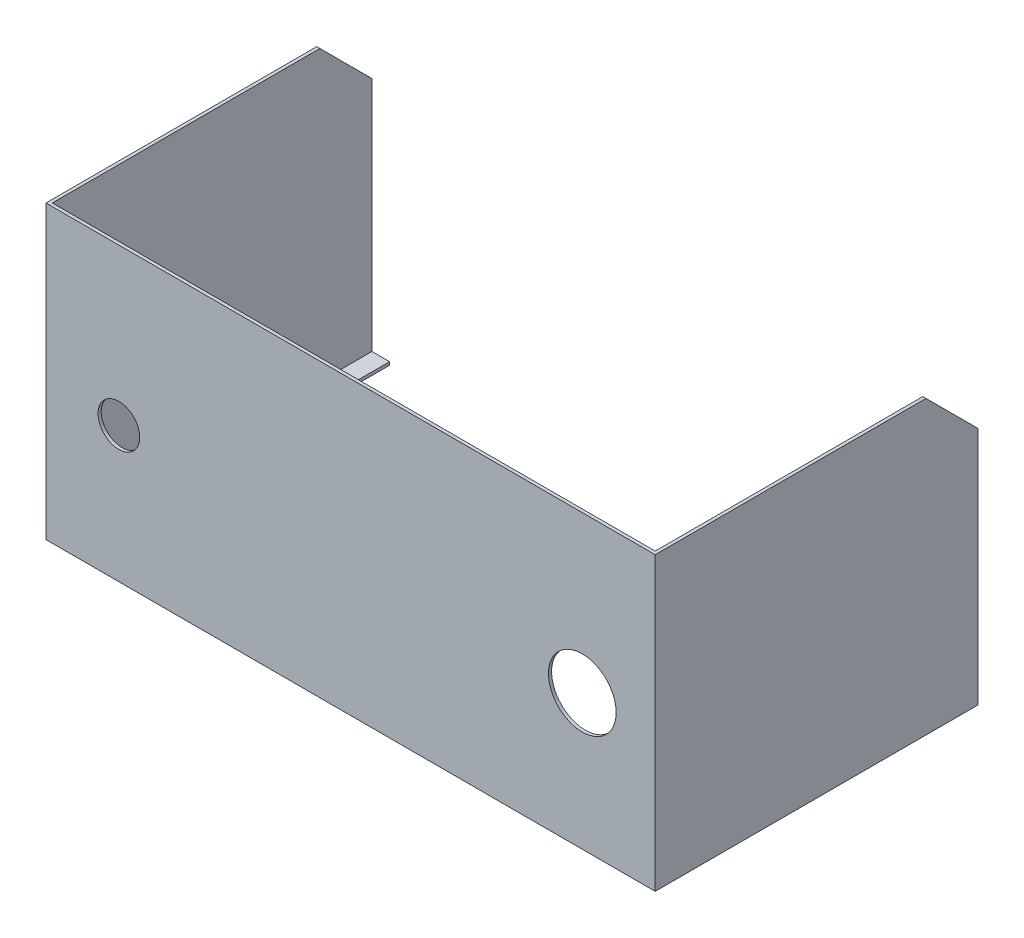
from build123d import *

# Parameters (mm, degrees)
SKETCH_1_W          = 585
SKETCH_1_H          = 280
SKETCH_1_R          = 20
SKETCH_1_R_2        = 32.5
EXTRUDE_1_DEPTH     = 3
EXTRUDE_2_DEPTH     = 3
EXTRUDE_3_DEPTH     = 3
EXTRUDE_4_DEPTH     = 3
SKETCH_5_R          = 1.75
CUT_EXTRUDE_1_DEPTH = 3


with BuildPart() as part:
    # Sketch 1 → Extrude 1 (new body)
    with BuildSketch(Plane.XY):
        Rectangle(SKETCH_1_W, SKETCH_1_H)
        with Locations((-222.5, -10)):
            Circle(SKETCH_1_R, mode=Mode.SUBTRACT)
        with Locations((222.5, -10)):
            Circle(SKETCH_1_R_2, mode=Mode.SUBTRACT)
    extrude(amount=EXTRUDE_1_DEPTH)

    # Sketch 2 → Extrude 2 (add)
    with BuildSketch(Plane(origin=(292.5, 0, 0), x_dir=(0, 0, -1), z_dir=(1, 0, 0))):
        Polygon((0, -140), (0, 140), (257, 140), (307, 90), (307, -140), align=None)
    extrude(amount=-EXTRUDE_2_DEPTH)

    # Sketch 3 → Extrude 3 (add)
    with BuildSketch(Plane.ZY.offset(292.5)):
        Polygon((-307, -140), (0, -140), (0, 140), (-257, 140), (-307, 90), align=None)
    extrude(amount=-EXTRUDE_3_DEPTH)

    # Sketch 4 → Extrude 4 (add)
    with BuildSketch(Plane.XZ.offset(140)):
        Polygon((272.5, -17), (-272.5, -17), (-272.5, -307), (-289.5, -307), (-289.5, 0), (289.5, 0), (289.5, -307), (272.5, -307), align=None)
    extrude(amount=-EXTRUDE_4_DEPTH)

    # Sketch 5 → Cut-Extrude 1 (cut)
    with BuildSketch(Plane.XZ.offset(140)):
        with Locations((280.5, -232)):
            Circle(SKETCH_5_R)
        with Locations((280.5, -92)):
            Circle(SKETCH_5_R)
        with Locations((137.5, -9)):
            Circle(SKETCH_5_R)
        with Locations((0, -9)):
            Circle(SKETCH_5_R)
        with Locations((-137.5, -9)):
            Circle(SKETCH_5_R)
        with Locations((-280.5, -232)):
            Circle(SKETCH_5_R)
        with Locations((-280.5, -92)):
            Circle(SKETCH_5_R)
    extrude(amount=-CUT_EXTRUDE_1_DEPTH, mode=Mode.SUBTRACT)


solid = part.part
